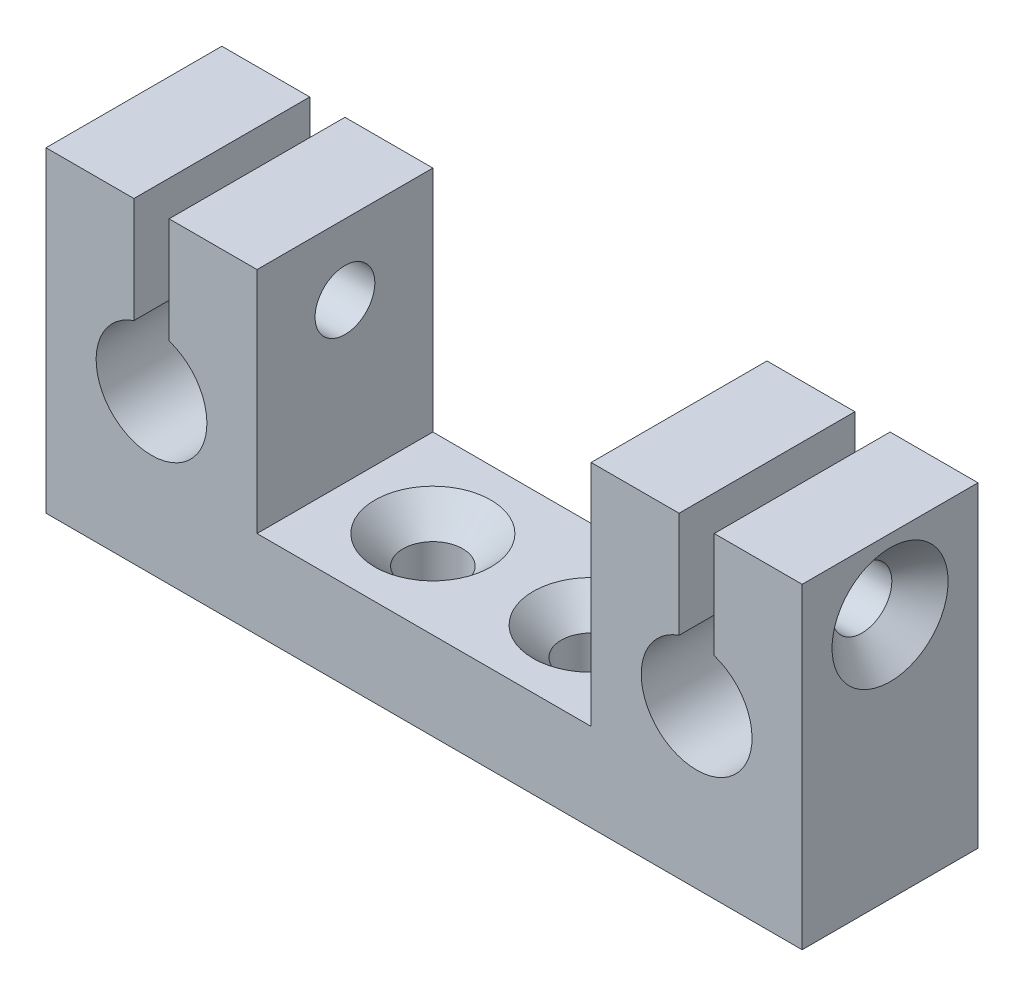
from build123d import *

# Parameters (mm, degrees)
SKETCH_1_W                   = 12
SKETCH_1_H                   = 13
SKETCH_1_W_2                 = 55
SKETCH_1_H_2                 = 5
EXTRUDE_1_DEPTH              = 10
SKETCH_2_R                   = 3.15
CUT_EXTRUDE_1_DEPTH          = 10
SKETCH_3_W                   = 2
SKETCH_3_H                   = 9.022276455
SKETCH_3_H_2                 = 9.579832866
CUT_EXTRUDE_2_DEPTH          = 10
HOLE_WIZARD_M3_1_D           = 3.4
HOLE_WIZARD_M3_1_DEPTH       = 20
HOLE_WIZARD_M3_1_CSINK_D     = 6.6
HOLE_WIZARD_M3_1_CSINK_ANGLE = 90
HOLE_WIZARD_M3_1_TIP         = 1.021463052
HOLE_WIZARD_M3_2_D           = 3.4
HOLE_WIZARD_M3_2_DEPTH       = 20
HOLE_WIZARD_M3_2_CSINK_D     = 6.6
HOLE_WIZARD_M3_2_CSINK_ANGLE = 90
HOLE_WIZARD_M3_2_TIP         = 1.021463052
HOLE_WIZARD_M3_3_D           = 3.4
HOLE_WIZARD_M3_3_DEPTH       = 11.5
HOLE_WIZARD_M3_3_CSINK_D     = 6.6
HOLE_WIZARD_M3_3_CSINK_ANGLE = 90
HOLE_WIZARD_M3_3_TIP         = 1.021463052
SKETCH_12_W                  = 10
SKETCH_12_H                  = 5
CUT_EXTRUDE_3_DEPTH          = 6
SKETCH_13_W                  = 10
SKETCH_13_H                  = 5
CUT_EXTRUDE_4_DEPTH          = 6


with BuildPart() as part:
    # Sketch 1 → Extrude 1 (new body)
    with BuildSketch(Plane.XY):
        with Locations((-15.5, 9)):
            Rectangle(SKETCH_1_W, SKETCH_1_H)
        Rectangle(SKETCH_1_W_2, SKETCH_1_H_2)
        with Locations((15.5, 9)):
            Rectangle(SKETCH_1_W, SKETCH_1_H)
    extrude(amount=EXTRUDE_1_DEPTH)

    # Sketch 2 → Cut-Extrude 1 (cut)
    with BuildSketch(Plane.XY.offset(10)):
        with Locations((-15.5, 6.5)):
            Circle(SKETCH_2_R)
        with Locations((15.5, 6.5)):
            Circle(SKETCH_2_R)
    extrude(amount=-CUT_EXTRUDE_1_DEPTH, mode=Mode.SUBTRACT)

    # Sketch 3 → Cut-Extrude 2 (cut)
    with BuildSketch(Plane.XY.offset(10)):
        with Locations((-15.5, 12.442520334)):
            Rectangle(SKETCH_3_W, SKETCH_3_H)
        with Locations((15.5, 12.721298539)):
            Rectangle(SKETCH_3_W, SKETCH_3_H_2)
    extrude(amount=-CUT_EXTRUDE_2_DEPTH, mode=Mode.SUBTRACT)

    # Hole Wizard M3 _1
    with Locations(Plane.ZY.offset(21.5)):
        with Locations((5, 11.5)):
            CounterSinkHole(HOLE_WIZARD_M3_1_D / 2, HOLE_WIZARD_M3_1_CSINK_D / 2, depth=HOLE_WIZARD_M3_1_DEPTH, counter_sink_angle=HOLE_WIZARD_M3_1_CSINK_ANGLE)
            with Locations((0, 0, -(HOLE_WIZARD_M3_1_DEPTH + HOLE_WIZARD_M3_1_TIP / 2))):  # 118° drill point
                Cone(0, HOLE_WIZARD_M3_1_D / 2, HOLE_WIZARD_M3_1_TIP, mode=Mode.SUBTRACT)

    # Hole Wizard M3 _2
    with Locations(Plane(origin=(21.5, 0, 0), x_dir=(0, 0, -1), z_dir=(1, 0, 0))):
        with Locations((-5, 11.5)):
            CounterSinkHole(HOLE_WIZARD_M3_2_D / 2, HOLE_WIZARD_M3_2_CSINK_D / 2, depth=HOLE_WIZARD_M3_2_DEPTH, counter_sink_angle=HOLE_WIZARD_M3_2_CSINK_ANGLE)
            with Locations((0, 0, -(HOLE_WIZARD_M3_2_DEPTH + HOLE_WIZARD_M3_2_TIP / 2))):  # 118° drill point
                Cone(0, HOLE_WIZARD_M3_2_D / 2, HOLE_WIZARD_M3_2_TIP, mode=Mode.SUBTRACT)

    # Hole Wizard M3 _3
    with Locations(Plane(origin=(0, 2.5, 0), x_dir=(1, 0, 0), z_dir=(0, 1, 0))):
        with Locations((-4.5, -5), (4.5, -5)):
            CounterSinkHole(HOLE_WIZARD_M3_3_D / 2, HOLE_WIZARD_M3_3_CSINK_D / 2, depth=HOLE_WIZARD_M3_3_DEPTH, counter_sink_angle=HOLE_WIZARD_M3_3_CSINK_ANGLE)
            with Locations((0, 0, -(HOLE_WIZARD_M3_3_DEPTH + HOLE_WIZARD_M3_3_TIP / 2))):  # 118° drill point
                Cone(0, HOLE_WIZARD_M3_3_D / 2, HOLE_WIZARD_M3_3_TIP, mode=Mode.SUBTRACT)

    # Sketch 12 → Cut-Extrude 3 (cut)
    with BuildSketch(Plane.ZY.offset(27.5)):
        with Locations((5, 0)):
            Rectangle(SKETCH_12_W, SKETCH_12_H)
    extrude(amount=-CUT_EXTRUDE_3_DEPTH, mode=Mode.SUBTRACT)

    # Sketch 13 → Cut-Extrude 4 (cut)
    with BuildSketch(Plane(origin=(27.5, 0, 0), x_dir=(0, 0, -1), z_dir=(1, 0, 0))):
        with Locations((-5, 0)):
            Rectangle(SKETCH_13_W, SKETCH_13_H)
    extrude(amount=-CUT_EXTRUDE_4_DEPTH, mode=Mode.SUBTRACT)


solid = part.part
